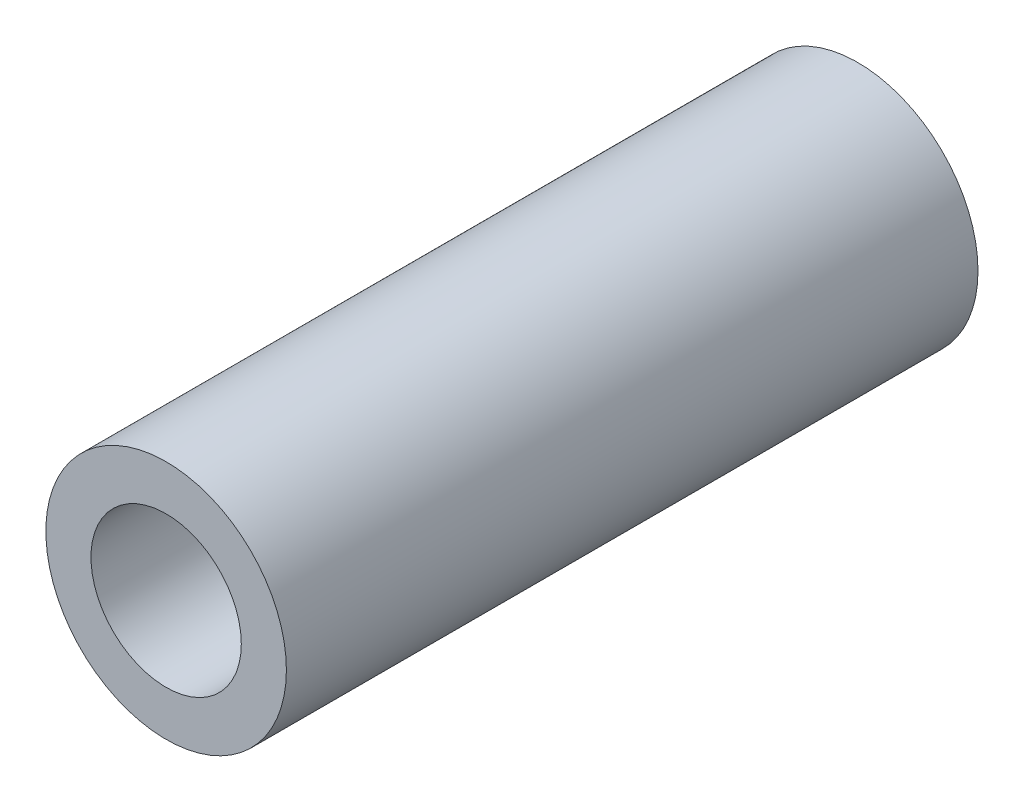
from build123d import *

# Parameters (mm, degrees)
CROQUIS1_R              = 4
CROQUIS1_R_2            = 2.5
SALIENTE_EXTRUIR1_DEPTH = 23


with BuildPart() as part:
    # Croquis1 → Saliente-Extruir1 (new body)
    with BuildSketch(Plane.XY):
        Circle(CROQUIS1_R)
        Circle(CROQUIS1_R_2, mode=Mode.SUBTRACT)
    extrude(amount=SALIENTE_EXTRUIR1_DEPTH)


solid = part.part
